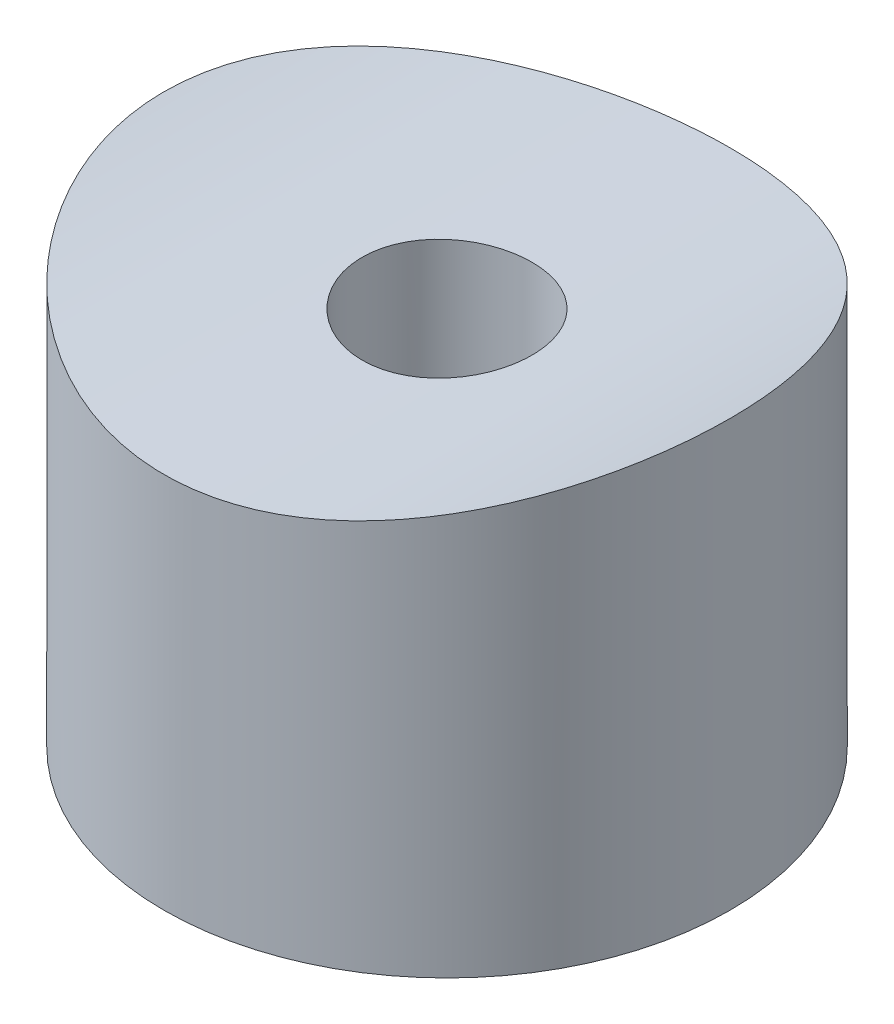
ISO-10303-21;
HEADER;
FILE_DESCRIPTION(('STEP AP214'),'2;1');
FILE_NAME('part.step','',(''),(''),'','','');
FILE_SCHEMA(('AUTOMOTIVE_DESIGN { 1 0 10303 214 1 1 1 1 }'));
ENDSEC;
DATA;
#1=APPLICATION_CONTEXT('core data for automotive mechanical design processes');
#2=APPLICATION_PROTOCOL_DEFINITION('international standard','automotive_design',2000,#1);
#3=PRODUCT_CONTEXT('',#1,'mechanical');
#4=PRODUCT('Part','Part','',(#3));
#5=PRODUCT_RELATED_PRODUCT_CATEGORY('part','',(#4));
#6=PRODUCT_DEFINITION_FORMATION('','',#4);
#7=PRODUCT_DEFINITION_CONTEXT('part definition',#1,'design');
#8=PRODUCT_DEFINITION('design','',#6,#7);
#9=PRODUCT_DEFINITION_SHAPE('','',#8);
#10=(LENGTH_UNIT() NAMED_UNIT(*) SI_UNIT(.MILLI.,.METRE.));
#11=(NAMED_UNIT(*) PLANE_ANGLE_UNIT() SI_UNIT($,.RADIAN.));
#12=(NAMED_UNIT(*) SI_UNIT($,.STERADIAN.) SOLID_ANGLE_UNIT());
#13=UNCERTAINTY_MEASURE_WITH_UNIT(LENGTH_MEASURE(1.E-05),#10,'distance_accuracy_value','');
#14=(GEOMETRIC_REPRESENTATION_CONTEXT(3) GLOBAL_UNCERTAINTY_ASSIGNED_CONTEXT((#13)) GLOBAL_UNIT_ASSIGNED_CONTEXT((#10,
#11,#12)) REPRESENTATION_CONTEXT('',''));
#15=CARTESIAN_POINT('',(0.,0.,0.));
#16=DIRECTION('',(0.,0.,1.));
#17=DIRECTION('',(1.,0.,0.));
#18=AXIS2_PLACEMENT_3D('',#15,#16,#17);
#19=CARTESIAN_POINT('',(0.,0.,0.));
#20=DIRECTION('',(0.,1.,0.));
#21=DIRECTION('',(0.,0.,1.));
#22=AXIS2_PLACEMENT_3D('',#19,#20,#21);
#23=PLANE('',#22);
#24=CARTESIAN_POINT('',(0.,0.,0.));
#25=DIRECTION('',(0.,1.,0.));
#26=DIRECTION('',(0.,0.,1.));
#27=AXIS2_PLACEMENT_3D('',#24,#25,#26);
#28=CIRCLE('',#27,7.5);
#29=CARTESIAN_POINT('',(0.,0.,7.5));
#30=VERTEX_POINT('',#29);
#31=EDGE_CURVE('E10',#30,#30,#28,.T.);
#32=ORIENTED_EDGE('',*,*,#31,.F.);
#33=EDGE_LOOP('',(#32));
#34=FACE_BOUND('',#33,.T.);
#35=CARTESIAN_POINT('',(0.,0.,0.));
#36=DIRECTION('',(0.,1.,0.));
#37=DIRECTION('',(0.,0.,1.));
#38=AXIS2_PLACEMENT_3D('',#35,#36,#37);
#39=CIRCLE('',#38,2.25);
#40=CARTESIAN_POINT('',(0.,0.,2.25));
#41=VERTEX_POINT('',#40);
#42=EDGE_CURVE('E41',#41,#41,#39,.T.);
#43=ORIENTED_EDGE('',*,*,#42,.T.);
#44=EDGE_LOOP('',(#43));
#45=FACE_BOUND('',#44,.T.);
#46=ADVANCED_FACE('F28',(#34,#45),#23,.F.);
#47=CARTESIAN_POINT('',(0.,12.,0.));
#48=DIRECTION('',(0.,-1.,0.));
#49=DIRECTION('',(0.,0.,-1.));
#50=AXIS2_PLACEMENT_3D('',#47,#48,#49);
#51=CYLINDRICAL_SURFACE('',#50,7.5);
#52=CARTESIAN_POINT('',(0.,10.,-7.5));
#53=CARTESIAN_POINT('',(0.204613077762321,9.99999994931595,-7.50000007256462));
#54=CARTESIAN_POINT('',(0.40922496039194,10.0027975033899,-7.49161995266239));
#55=CARTESIAN_POINT('',(0.816927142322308,10.0139105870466,-7.45818108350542));
#56=CARTESIAN_POINT('',(1.02001745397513,10.0222260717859,-7.43312246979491));
#57=CARTESIAN_POINT('',(1.42317028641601,10.044146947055,-7.36656785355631));
#58=CARTESIAN_POINT('',(1.62323314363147,10.0577517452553,-7.32507369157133));
#59=CARTESIAN_POINT('',(2.01900886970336,10.0898896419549,-7.22601125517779));
#60=CARTESIAN_POINT('',(2.21472002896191,10.1084246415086,-7.16843677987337));
#61=CARTESIAN_POINT('',(2.59998757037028,10.149887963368,-7.03785024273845));
#62=CARTESIAN_POINT('',(2.78955597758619,10.1728070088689,-6.96487074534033));
#63=CARTESIAN_POINT('',(3.1617677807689,10.2224651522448,-6.8039979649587));
#64=CARTESIAN_POINT('',(3.34440853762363,10.2492056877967,-6.71609906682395));
#65=CARTESIAN_POINT('',(3.88009121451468,10.3341439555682,-6.43103871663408));
#66=CARTESIAN_POINT('',(4.22122248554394,10.3970955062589,-6.21240137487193));
#67=CARTESIAN_POINT('',(4.87315917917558,10.5314585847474,-5.71623570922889));
#68=CARTESIAN_POINT('',(5.18268543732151,10.6030728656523,-5.43708200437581));
#69=CARTESIAN_POINT('',(5.60911767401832,10.7098785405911,-4.98307893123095));
#70=CARTESIAN_POINT('',(5.74502516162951,10.7453997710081,-4.82575666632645));
#71=CARTESIAN_POINT('',(6.00341316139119,10.815283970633,-4.5002390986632));
#72=CARTESIAN_POINT('',(6.12589861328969,10.8496473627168,-4.33204783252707));
#73=CARTESIAN_POINT('',(6.36001044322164,10.9172393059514,-3.98072022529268));
#74=CARTESIAN_POINT('',(6.47121489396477,10.9504053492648,-3.79729077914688));
#75=CARTESIAN_POINT('',(6.67767203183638,11.0134845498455,-3.42121132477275));
#76=CARTESIAN_POINT('',(6.77293063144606,11.0433989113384,-3.22856476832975));
#77=CARTESIAN_POINT('',(6.94674693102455,11.0990411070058,-2.83529931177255));
#78=CARTESIAN_POINT('',(7.02530530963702,11.1247691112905,-2.63468073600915));
#79=CARTESIAN_POINT('',(7.16500838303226,11.1711912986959,-2.2269030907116));
#80=CARTESIAN_POINT('',(7.22615386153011,11.1918857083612,-2.01974431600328));
#81=CARTESIAN_POINT('',(7.32867363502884,11.2269330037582,-1.60752040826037));
#82=CARTESIAN_POINT('',(7.37064448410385,11.2414760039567,-1.4026197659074));
#83=CARTESIAN_POINT('',(7.43735231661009,11.2647217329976,-0.989707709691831));
#84=CARTESIAN_POINT('',(7.46209008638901,11.2734247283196,-0.781696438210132));
#85=CARTESIAN_POINT('',(7.494075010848,11.2846958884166,-0.364220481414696));
#86=CARTESIAN_POINT('',(7.50132662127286,11.2872656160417,-0.154756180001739));
#87=CARTESIAN_POINT('',(7.49827538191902,11.286186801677,0.264025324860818));
#88=CARTESIAN_POINT('',(7.48797302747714,11.282538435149,0.473342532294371));
#89=CARTESIAN_POINT('',(7.45079975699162,11.269457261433,0.880599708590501));
#90=CARTESIAN_POINT('',(7.42471181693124,11.2602979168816,1.07862055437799));
#91=CARTESIAN_POINT('',(7.3568916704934,11.2367116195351,1.47171243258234));
#92=CARTESIAN_POINT('',(7.3151542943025,11.2222829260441,1.6667824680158));
#93=CARTESIAN_POINT('',(7.21642177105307,11.188595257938,2.052531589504));
#94=CARTESIAN_POINT('',(7.15943085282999,11.1693376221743,2.2432118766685));
#95=CARTESIAN_POINT('',(7.03063889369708,11.1265417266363,2.61908393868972));
#96=CARTESIAN_POINT('',(6.95883222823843,11.103001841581,2.8042735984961));
#97=CARTESIAN_POINT('',(6.79973746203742,11.0519078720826,3.17082220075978));
#98=CARTESIAN_POINT('',(6.71222377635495,11.0242965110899,3.35207518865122));
#99=CARTESIAN_POINT('',(6.52311870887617,10.9661032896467,3.70665765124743));
#100=CARTESIAN_POINT('',(6.42152251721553,10.935520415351,3.87998439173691));
#101=CARTESIAN_POINT('',(6.20495632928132,10.8722113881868,4.21767156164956));
#102=CARTESIAN_POINT('',(6.08998541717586,10.8394850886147,4.38203137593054));
#103=CARTESIAN_POINT('',(5.84739639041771,10.772741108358,4.70085999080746));
#104=CARTESIAN_POINT('',(5.71977782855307,10.7387233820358,4.85532844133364));
#105=CARTESIAN_POINT('',(5.44563865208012,10.6684615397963,5.16133690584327));
#106=CARTESIAN_POINT('',(5.2984777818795,10.6321942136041,5.31229865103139));
#107=CARTESIAN_POINT('',(4.99195680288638,10.5601927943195,5.60131468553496));
#108=CARTESIAN_POINT('',(4.83260055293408,10.5244585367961,5.73937302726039));
#109=CARTESIAN_POINT('',(4.50254798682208,10.4544669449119,6.00179393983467));
#110=CARTESIAN_POINT('',(4.33184631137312,10.4202103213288,6.12614996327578));
#111=CARTESIAN_POINT('',(3.98030175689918,10.3541388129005,6.36017033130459));
#112=CARTESIAN_POINT('',(3.79946292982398,10.3223229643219,6.46984048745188));
#113=CARTESIAN_POINT('',(3.42681033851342,10.2616779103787,6.67477740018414));
#114=CARTESIAN_POINT('',(3.23490212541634,10.2328831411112,6.769882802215));
#115=CARTESIAN_POINT('',(2.84323366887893,10.1794922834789,6.94347802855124));
#116=CARTESIAN_POINT('',(2.64347650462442,10.1548945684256,7.02197429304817));
#117=CARTESIAN_POINT('',(2.23749152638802,10.1105980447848,7.16168359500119));
#118=CARTESIAN_POINT('',(2.0312642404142,10.0908988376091,7.22289803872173));
#119=CARTESIAN_POINT('',(1.61388858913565,10.0569790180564,7.32745799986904));
#120=CARTESIAN_POINT('',(1.40274045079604,10.0427581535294,7.37080433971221));
#121=CARTESIAN_POINT('',(0.986422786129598,10.0207090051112,7.43770625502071));
#122=CARTESIAN_POINT('',(0.781391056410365,10.0126302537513,7.46203853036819));
#123=CARTESIAN_POINT('',(0.369877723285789,10.0020990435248,7.49371555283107));
#124=CARTESIAN_POINT('',(0.163396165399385,9.99964640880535,7.50106083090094));
#125=CARTESIAN_POINT('',(-0.249426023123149,10.0004358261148,7.49869246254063));
#126=CARTESIAN_POINT('',(-0.455766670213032,10.0036770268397,7.48898136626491));
#127=CARTESIAN_POINT('',(-0.86677966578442,10.0157619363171,7.45260058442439));
#128=CARTESIAN_POINT('',(-1.07145203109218,10.0246055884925,7.42593107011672));
#129=CARTESIAN_POINT('',(-1.47167255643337,10.0473124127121,7.35691551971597));
#130=CARTESIAN_POINT('',(-1.66731262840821,10.0610214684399,7.3150499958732));
#131=CARTESIAN_POINT('',(-2.05432753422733,10.0931382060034,7.21593051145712));
#132=CARTESIAN_POINT('',(-2.24570092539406,10.1115474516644,7.15867142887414));
#133=CARTESIAN_POINT('',(-2.6228161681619,10.1525883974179,7.02926504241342));
#134=CARTESIAN_POINT('',(-2.80855951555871,10.1752189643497,6.95712173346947));
#135=CARTESIAN_POINT('',(-3.17338401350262,10.2241492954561,6.79847173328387));
#136=CARTESIAN_POINT('',(-3.35246261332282,10.2504504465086,6.71195961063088));
#137=CARTESIAN_POINT('',(-3.70737221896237,10.3067913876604,6.52279609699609));
#138=CARTESIAN_POINT('',(-3.88299853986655,10.3369104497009,6.4197843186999));
#139=CARTESIAN_POINT('',(-4.22505723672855,10.3995669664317,6.20001883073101));
#140=CARTESIAN_POINT('',(-4.39148641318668,10.4321052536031,6.08326038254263));
#141=CARTESIAN_POINT('',(-4.71414142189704,10.4987724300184,5.83678750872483));
#142=CARTESIAN_POINT('',(-4.87036626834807,10.532901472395,5.70707183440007));
#143=CARTESIAN_POINT('',(-5.17170542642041,10.6018868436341,5.4354950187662));
#144=CARTESIAN_POINT('',(-5.31681944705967,10.6367431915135,5.29363355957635));
#145=CARTESIAN_POINT('',(-5.60145834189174,10.7078876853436,4.99185600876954));
#146=CARTESIAN_POINT('',(-5.74042513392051,10.7441685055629,4.83141120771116));
#147=CARTESIAN_POINT('',(-6.00433661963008,10.815521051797,4.49921424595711));
#148=CARTESIAN_POINT('',(-6.1292859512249,10.850593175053,4.32746585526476));
#149=CARTESIAN_POINT('',(-6.36440000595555,10.9185404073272,3.97360703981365));
#150=CARTESIAN_POINT('',(-6.47455851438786,10.9514145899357,3.79149230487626));
#151=CARTESIAN_POINT('',(-6.67915795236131,11.0139511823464,3.41820554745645));
#152=CARTESIAN_POINT('',(-6.77360542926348,11.043614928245,3.22703734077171));
#153=CARTESIAN_POINT('',(-6.94592859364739,11.0987791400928,2.83715150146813));
#154=CARTESIAN_POINT('',(-7.02383010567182,11.1242860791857,2.6384462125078));
#155=CARTESIAN_POINT('',(-7.1625245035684,11.170358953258,2.23467834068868));
#156=CARTESIAN_POINT('',(-7.22332431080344,11.190926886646,2.02961836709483));
#157=CARTESIAN_POINT('',(-7.32725955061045,11.2264415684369,1.61462494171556));
#158=CARTESIAN_POINT('',(-7.37039804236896,11.2413892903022,1.40469234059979));
#159=CARTESIAN_POINT('',(-7.43857763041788,11.2651495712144,0.981568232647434));
#160=CARTESIAN_POINT('',(-7.46361963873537,11.2739624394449,0.768376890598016));
#161=CARTESIAN_POINT('',(-7.49452360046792,11.2848552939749,0.351476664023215));
#162=CARTESIAN_POINT('',(-7.50130560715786,11.287258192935,0.147843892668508));
#163=CARTESIAN_POINT('',(-7.49828044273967,11.286188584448,-0.259281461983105));
#164=CARTESIAN_POINT('',(-7.48847363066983,11.2827162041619,-0.462774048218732));
#165=CARTESIAN_POINT('',(-7.45236960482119,11.2700082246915,-0.868091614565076));
#166=CARTESIAN_POINT('',(-7.42607353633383,11.2607730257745,-1.06991670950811));
#167=CARTESIAN_POINT('',(-7.35724648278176,11.2368335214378,-1.47044728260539));
#168=CARTESIAN_POINT('',(-7.31471544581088,11.2221291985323,-1.66915275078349));
#169=CARTESIAN_POINT('',(-7.21478384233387,11.1880404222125,-2.05826800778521));
#170=CARTESIAN_POINT('',(-7.15768498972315,11.1687514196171,-2.24876384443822));
#171=CARTESIAN_POINT('',(-7.02870548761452,11.1259055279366,-2.62425628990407));
#172=CARTESIAN_POINT('',(-6.95681991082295,11.1023472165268,-2.80925104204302));
#173=CARTESIAN_POINT('',(-6.79884967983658,11.0516313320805,-3.17251743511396));
#174=CARTESIAN_POINT('',(-6.71276757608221,11.0244744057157,-3.3507902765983));
#175=CARTESIAN_POINT('',(-6.52697547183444,10.9672798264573,-3.69968517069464));
#176=CARTESIAN_POINT('',(-6.42726030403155,10.937241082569,-3.87030428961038));
#177=CARTESIAN_POINT('',(-6.21027965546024,10.8737255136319,-4.21008286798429));
#178=CARTESIAN_POINT('',(-6.09244126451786,10.8401561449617,-4.37885934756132));
#179=CARTESIAN_POINT('',(-5.84340818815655,10.7716484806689,-4.70604559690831));
#180=CARTESIAN_POINT('',(-5.71220884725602,10.7367097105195,-4.86445172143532));
#181=CARTESIAN_POINT('',(-5.4372889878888,10.6664016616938,-5.16992409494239));
#182=CARTESIAN_POINT('',(-5.29356724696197,10.6310323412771,-5.31698923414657));
#183=CARTESIAN_POINT('',(-4.99447222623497,10.5607921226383,-5.59888195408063));
#184=CARTESIAN_POINT('',(-4.83909885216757,10.5259212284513,-5.73370943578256));
#185=CARTESIAN_POINT('',(-4.51129489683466,10.4562394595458,-5.99532298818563));
#186=CARTESIAN_POINT('',(-4.33843419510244,10.421484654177,-6.12158577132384));
#187=CARTESIAN_POINT('',(-3.9822773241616,10.3544748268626,-6.35902959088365));
#188=CARTESIAN_POINT('',(-3.79898489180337,10.3222189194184,-6.47021598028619));
#189=CARTESIAN_POINT('',(-3.42307420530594,10.2610965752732,-6.67671759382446));
#190=CARTESIAN_POINT('',(-3.23045416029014,10.2322307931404,-6.77202975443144));
#191=CARTESIAN_POINT('',(-2.83732927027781,10.1787346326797,-6.94591485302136));
#192=CARTESIAN_POINT('',(-2.63682799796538,10.1541023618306,-7.02449527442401));
#193=CARTESIAN_POINT('',(-2.23834924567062,10.1107578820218,-7.16115725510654));
#194=CARTESIAN_POINT('',(-2.04065340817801,10.0918317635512,-7.21999266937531));
#195=CARTESIAN_POINT('',(-1.64077087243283,10.0590086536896,-7.32122857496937));
#196=CARTESIAN_POINT('',(-1.4385861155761,10.0451095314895,-7.36363603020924));
#197=CARTESIAN_POINT('',(-1.03111970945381,10.022713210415,-7.43165217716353));
#198=CARTESIAN_POINT('',(-0.825838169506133,10.0142158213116,-7.45726146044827));
#199=CARTESIAN_POINT('',(-0.413704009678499,10.0028592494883,-7.49143531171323));
#200=CARTESIAN_POINT('',(-0.206851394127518,10.0000000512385,-7.49999992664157));
#201=CARTESIAN_POINT('',(0.,10.,-7.5));
#202=B_SPLINE_CURVE_WITH_KNOTS('',3,(#52,#53,#54,#55,#56,#57,#58,#59,#60,#61,#62,#63,#64,#65,
#66,#67,#68,#69,#70,#71,#72,#73,#74,#75,#76,#77,#78,#79,#80,#81,#82,#83,#84,#85,#86,#87,#88,#89,
#90,#91,#92,#93,#94,#95,#96,#97,#98,#99,#100,#101,#102,#103,#104,#105,#106,#107,#108,#109,#110,
#111,#112,#113,#114,#115,#116,#117,#118,#119,#120,#121,#122,#123,#124,#125,#126,#127,#128,#129,
#130,#131,#132,#133,#134,#135,#136,#137,#138,#139,#140,#141,#142,#143,#144,#145,#146,#147,#148,
#149,#150,#151,#152,#153,#154,#155,#156,#157,#158,#159,#160,#161,#162,#163,#164,#165,#166,#167,
#168,#169,#170,#171,#172,#173,#174,#175,#176,#177,#178,#179,#180,#181,#182,#183,#184,#185,#186,
#187,#188,#189,#190,#191,#192,#193,#194,#195,#196,#197,#198,#199,#200,#201),.UNSPECIFIED.,.T.,
.F.,(4,2,2,2,2,2,2,2,2,2,2,2,2,2,2,2,2,2,2,2,2,2,2,2,2,2,2,2,2,2,2,2,2,2,2,2,2,2,2,2,2,2,2,2,2,
2,2,2,2,2,2,2,2,2,2,2,2,2,2,2,2,2,2,2,2,2,2,2,2,2,2,2,2,2,4),(0.,0.613647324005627,
1.22728966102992,1.84086329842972,2.45467386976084,3.06719968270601,3.67995654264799,
4.90443432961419,6.16713781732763,6.79927862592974,7.43118599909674,8.08155932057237,
8.73169095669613,9.38179616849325,10.0318721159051,10.6600526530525,11.288204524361,
11.9161963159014,12.5441703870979,13.1432927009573,13.7426131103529,14.3417675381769,
14.9411498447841,15.5499526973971,16.1589640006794,16.7680170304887,17.377091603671,
18.0181035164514,18.6589134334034,19.3000282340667,19.9408885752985,20.5884022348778,
21.2356643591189,21.8828737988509,22.5300534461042,23.1491686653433,23.7682645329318,
24.3872678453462,25.0062649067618,25.6071865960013,26.2083084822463,26.8092692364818,
27.4104576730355,28.0272382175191,28.6442319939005,29.2612852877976,29.8783547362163,
30.5236108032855,31.1686527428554,31.8139648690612,32.4590073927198,33.1030356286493,
33.7468028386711,34.3904584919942,35.034081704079,35.6446087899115,36.2551226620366,
36.8655941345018,37.4760675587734,38.0747999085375,38.6737320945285,39.2725567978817,
39.8716091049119,40.4965961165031,41.1218016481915,41.7470682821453,42.3723399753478,
43.0221519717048,43.6717326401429,44.3214385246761,44.9708532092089,45.5915003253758,
46.2118840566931,46.8322459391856,47.4526061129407),.UNSPECIFIED.);
#203=CARTESIAN_POINT('',(0.,10.,-7.5));
#204=VERTEX_POINT('',#203);
#205=EDGE_CURVE('E45',#204,#204,#202,.T.);
#206=ORIENTED_EDGE('',*,*,#205,.T.);
#207=EDGE_LOOP('',(#206));
#208=FACE_BOUND('',#207,.T.);
#209=ORIENTED_EDGE('',*,*,#31,.T.);
#210=EDGE_LOOP('',(#209));
#211=FACE_BOUND('',#210,.T.);
#212=ADVANCED_FACE('F30',(#208,#211),#51,.T.);
#213=CARTESIAN_POINT('',(0.,12.,0.));
#214=DIRECTION('',(0.,-1.,0.));
#215=DIRECTION('',(0.,0.,-1.));
#216=AXIS2_PLACEMENT_3D('',#213,#214,#215);
#217=CYLINDRICAL_SURFACE('',#216,2.25);
#218=CARTESIAN_POINT('',(0.,10.,-2.25));
#219=CARTESIAN_POINT('',(0.126045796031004,10.0000014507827,-2.24999454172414));
#220=CARTESIAN_POINT('',(0.252174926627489,10.0010704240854,-2.239372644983));
#221=CARTESIAN_POINT('',(0.500936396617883,10.0052319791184,-2.19716016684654));
#222=CARTESIAN_POINT('',(0.623564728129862,10.0083267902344,-2.16554648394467));
#223=CARTESIAN_POINT('',(0.861686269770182,10.0161906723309,-2.08227995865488));
#224=CARTESIAN_POINT('',(0.977183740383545,10.0209587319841,-2.03063921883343));
#225=CARTESIAN_POINT('',(1.19784636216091,10.0316359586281,-1.9088079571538));
#226=CARTESIAN_POINT('',(1.30301356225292,10.037544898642,-1.83862112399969));
#227=CARTESIAN_POINT('',(1.50043398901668,10.0498657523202,-1.68141893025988));
#228=CARTESIAN_POINT('',(1.59264482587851,10.056279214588,-1.59435045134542));
#229=CARTESIAN_POINT('',(1.76117067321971,10.0688734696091,-1.40596979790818));
#230=CARTESIAN_POINT('',(1.83748494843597,10.0750542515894,-1.30465696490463));
#231=CARTESIAN_POINT('',(1.97220143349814,10.0864991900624,-1.09039830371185));
#232=CARTESIAN_POINT('',(2.03056529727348,10.0917613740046,-0.977428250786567));
#233=CARTESIAN_POINT('',(2.12747936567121,10.1007541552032,-0.743229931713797));
#234=CARTESIAN_POINT('',(2.1660300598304,10.1044847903,-0.622001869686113));
#235=CARTESIAN_POINT('',(2.22209784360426,10.109978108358,-0.375160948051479));
#236=CARTESIAN_POINT('',(2.23968521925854,10.1117473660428,-0.249564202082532));
#237=CARTESIAN_POINT('',(2.25354439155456,10.1131380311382,0.00280994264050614));
#238=CARTESIAN_POINT('',(2.2498167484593,10.1127594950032,0.129587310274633));
#239=CARTESIAN_POINT('',(2.22120963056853,10.109903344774,0.380239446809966));
#240=CARTESIAN_POINT('',(2.19640689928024,10.1074333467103,0.504123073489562));
#241=CARTESIAN_POINT('',(2.12647307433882,10.1006844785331,0.745960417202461));
#242=CARTESIAN_POINT('',(2.08134170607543,10.0964055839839,0.86391405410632));
#243=CARTESIAN_POINT('',(1.97194701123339,10.0865122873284,1.0907855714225));
#244=CARTESIAN_POINT('',(1.90764963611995,10.0808955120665,1.19968692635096));
#245=CARTESIAN_POINT('',(1.76177256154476,10.0689613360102,1.40518173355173));
#246=CARTESIAN_POINT('',(1.68019235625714,10.0626439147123,1.50177482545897));
#247=CARTESIAN_POINT('',(1.50163675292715,10.0499863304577,1.68035713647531));
#248=CARTESIAN_POINT('',(1.40459507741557,10.0436461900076,1.76228010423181));
#249=CARTESIAN_POINT('',(1.1981013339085,10.0316838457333,1.90868317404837));
#250=CARTESIAN_POINT('',(1.0886492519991,10.0260616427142,1.97316325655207));
#251=CARTESIAN_POINT('',(0.860395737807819,10.0161667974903,2.08284754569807));
#252=CARTESIAN_POINT('',(0.741592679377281,10.0118943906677,2.12804839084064));
#253=CARTESIAN_POINT('',(0.498031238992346,10.0051829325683,2.19784256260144));
#254=CARTESIAN_POINT('',(0.37327303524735,10.0027438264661,2.2224365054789));
#255=CARTESIAN_POINT('',(0.121916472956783,9.999980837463,2.25023469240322));
#256=CARTESIAN_POINT('',(-0.0046716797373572,9.99964791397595,2.25353035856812));
#257=CARTESIAN_POINT('',(-0.256598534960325,10.0011105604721,2.23887855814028));
#258=CARTESIAN_POINT('',(-0.381937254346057,10.0029061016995,2.22093137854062));
#259=CARTESIAN_POINT('',(-0.627543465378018,10.0084181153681,2.16437918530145));
#260=CARTESIAN_POINT('',(-0.747820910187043,10.0121306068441,2.12581697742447));
#261=CARTESIAN_POINT('',(-0.980199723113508,10.0210600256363,2.02917335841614));
#262=CARTESIAN_POINT('',(-1.09230090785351,10.0262769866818,1.97109150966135));
#263=CARTESIAN_POINT('',(-1.30555840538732,10.0376543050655,1.83683061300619));
#264=CARTESIAN_POINT('',(-1.40667673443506,10.0438177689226,1.76059149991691));
#265=CARTESIAN_POINT('',(-1.59471365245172,10.0563865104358,1.59226634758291));
#266=CARTESIAN_POINT('',(-1.68163188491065,10.0627917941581,1.50017991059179));
#267=CARTESIAN_POINT('',(-1.83911874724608,10.075149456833,1.30237520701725));
#268=CARTESIAN_POINT('',(-1.90962737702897,10.0811001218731,1.1966090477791));
#269=CARTESIAN_POINT('',(-2.03188108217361,10.09184876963,0.974683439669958));
#270=CARTESIAN_POINT('',(-2.08362641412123,10.0966467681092,0.858524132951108));
#271=CARTESIAN_POINT('',(-2.16678421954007,10.1045361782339,0.619315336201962));
#272=CARTESIAN_POINT('',(-2.19823239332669,10.1076305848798,0.496278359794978));
#273=CARTESIAN_POINT('',(-2.24001901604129,10.1117717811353,0.246637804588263));
#274=CARTESIAN_POINT('',(-2.25035807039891,10.1128186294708,0.120034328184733));
#275=CARTESIAN_POINT('',(-2.24962456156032,10.1127449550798,-0.132549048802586));
#276=CARTESIAN_POINT('',(-2.2386462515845,10.1116339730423,-0.258529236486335));
#277=CARTESIAN_POINT('',(-2.19578726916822,10.1073901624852,-0.506846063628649));
#278=CARTESIAN_POINT('',(-2.16390657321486,10.1042573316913,-0.629182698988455));
#279=CARTESIAN_POINT('',(-2.08017379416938,10.0963254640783,-0.866739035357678));
#280=CARTESIAN_POINT('',(-2.02832447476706,10.0915266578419,-0.981959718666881));
#281=CARTESIAN_POINT('',(-1.90613599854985,10.0808030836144,-1.20207800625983));
#282=CARTESIAN_POINT('',(-1.83579694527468,10.0748783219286,-1.30697566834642));
#283=CARTESIAN_POINT('',(-1.67827175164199,10.0625390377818,-1.50395326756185));
#284=CARTESIAN_POINT('',(-1.5910153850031,10.0561225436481,-1.59597692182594));
#285=CARTESIAN_POINT('',(-1.40227132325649,10.0435407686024,-1.76411752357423));
#286=CARTESIAN_POINT('',(-1.30078022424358,10.037375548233,-1.84023065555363));
#287=CARTESIAN_POINT('',(-1.0861682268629,10.0259748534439,-1.9745402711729));
#288=CARTESIAN_POINT('',(-0.973018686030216,10.0207417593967,-2.03269115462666));
#289=CARTESIAN_POINT('',(-0.738581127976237,10.0118208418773,-2.1290904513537));
#290=CARTESIAN_POINT('',(-0.61730246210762,10.0081312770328,-2.16736130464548));
#291=CARTESIAN_POINT('',(-0.412781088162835,10.003640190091,-2.2133713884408));
#292=CARTESIAN_POINT('',(-0.330845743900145,10.0022814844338,-2.22708834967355));
#293=CARTESIAN_POINT('',(-0.165952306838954,10.0004609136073,-2.24540443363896));
#294=CARTESIAN_POINT('',(-0.0829942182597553,9.99999904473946,-2.25000359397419));
#295=CARTESIAN_POINT('',(0.,10.,-2.25));
#296=B_SPLINE_CURVE_WITH_KNOTS('',3,(#218,#219,#220,#221,#222,#223,#224,#225,#226,#227,#228,
#229,#230,#231,#232,#233,#234,#235,#236,#237,#238,#239,#240,#241,#242,#243,#244,#245,#246,#247,
#248,#249,#250,#251,#252,#253,#254,#255,#256,#257,#258,#259,#260,#261,#262,#263,#264,#265,#266,
#267,#268,#269,#270,#271,#272,#273,#274,#275,#276,#277,#278,#279,#280,#281,#282,#283,#284,#285,
#286,#287,#288,#289,#290,#291,#292,#293,#294,#295),.UNSPECIFIED.,.T.,.F.,(4,2,2,2,2,2,2,2,2,2,2,
2,2,2,2,2,2,2,2,2,2,2,2,2,2,2,2,2,2,2,2,2,2,2,2,2,2,2,4),(0.,0.377834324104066,
0.756085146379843,1.13410774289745,1.51205520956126,1.89121177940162,2.27038588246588,
2.65036444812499,3.03033362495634,3.40902522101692,3.78770686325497,4.16501544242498,
4.54232911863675,4.92031713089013,5.29831620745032,5.67798151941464,6.05764725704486,
6.43737916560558,6.81709971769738,7.19518924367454,7.57327366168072,7.95057604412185,
8.327886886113,8.70646366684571,9.08504995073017,9.46499948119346,9.84494381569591,
10.2242180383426,10.6034813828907,10.981071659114,11.3586623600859,11.736200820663,
12.1137371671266,12.4928756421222,12.8721049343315,13.2522891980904,13.6320433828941,
13.8808275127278,14.1296106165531),.UNSPECIFIED.);
#297=CARTESIAN_POINT('',(0.,10.,-2.25));
#298=VERTEX_POINT('',#297);
#299=EDGE_CURVE('E33',#298,#298,#296,.T.);
#300=ORIENTED_EDGE('',*,*,#299,.F.);
#301=EDGE_LOOP('',(#300));
#302=FACE_BOUND('',#301,.T.);
#303=ORIENTED_EDGE('',*,*,#42,.F.);
#304=EDGE_LOOP('',(#303));
#305=FACE_BOUND('',#304,.T.);
#306=ADVANCED_FACE('F54',(#302,#305),#217,.F.);
#307=CARTESIAN_POINT('',(0.,32.5,-10.));
#308=DIRECTION('',(0.,0.,1.));
#309=DIRECTION('',(1.,0.,0.));
#310=AXIS2_PLACEMENT_3D('',#307,#308,#309);
#311=CYLINDRICAL_SURFACE('',#310,22.5);
#312=ORIENTED_EDGE('',*,*,#299,.T.);
#313=EDGE_LOOP('',(#312));
#314=FACE_BOUND('',#313,.T.);
#315=ORIENTED_EDGE('',*,*,#205,.F.);
#316=EDGE_LOOP('',(#315));
#317=FACE_BOUND('',#316,.T.);
#318=ADVANCED_FACE('F51',(#314,#317),#311,.F.);
#319=CLOSED_SHELL('',(#46,#212,#306,#318));
#320=MANIFOLD_SOLID_BREP('B2',#319);
#321=ADVANCED_BREP_SHAPE_REPRESENTATION('',(#18,#320),#14);
#322=SHAPE_DEFINITION_REPRESENTATION(#9,#321);
ENDSEC;
END-ISO-10303-21;
